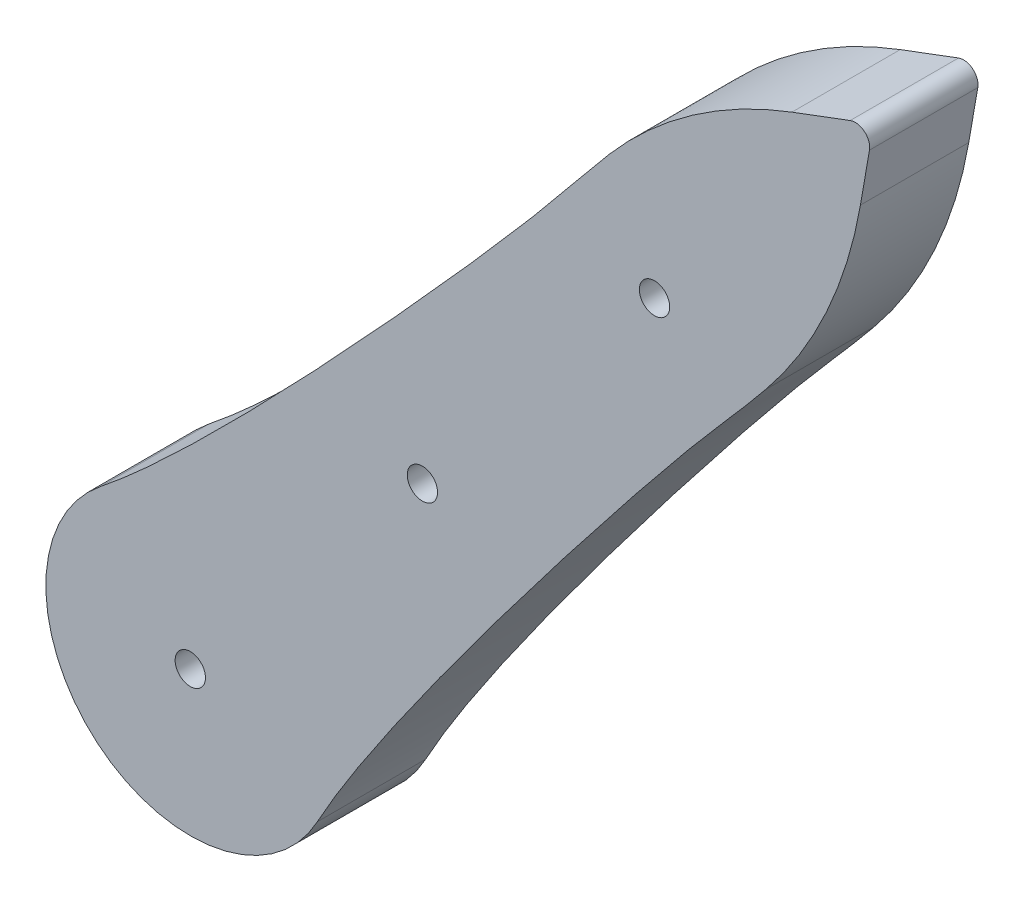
from build123d import *

# Parameters (mm, degrees)
SKETCH3_R           = 1.6
BOSS_EXTRUDE1_DEPTH = 15
CUT_EXTRUDE1_START  = -15
SKETCH4_R           = 1.6
CUT_EXTRUDE1_DEPTH  = 15
FILLET3_R           = 62
SKETCH5_R           = 2.1
CUT_EXTRUDE2_DEPTH  = 15
FILLET4_R           = 2


with BuildPart() as part:
    # Sketch3 → Boss-Extrude1 (new body)
    with BuildSketch(Plane.XY.offset(16)):
        with BuildLine():
            ThreePointArc((155.019115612, -142.985112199), (159.394881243, -97.849485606), (115.704809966, -109.996492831))
            add(Edge.make_bspline(
                [(115.704809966, -109.996492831), (101.94879758, -150.116707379), (78.178790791, -171.772825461), (58.717079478, -197.082387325), (16.356999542, -244.049515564), (0.72448619, -256.46124476)],
                knots=[0, 0, 0, 0, 0.619090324, 0.719090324, 1, 1, 1, 1], degree=3))
            ThreePointArc((0.72448619, -256.46124476), (0.304947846, -287.445485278), (30.74561606, -281.651963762))
            add(Edge.make_bspline(
                [(155.019115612, -142.985112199), (117.897123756, -163.498941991), (100.69762913, -190.668374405), (79.152067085, -214.229377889), (40.254225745, -264.101669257), (30.74561606, -281.651963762)],
                knots=[0, 0, 0, 0, 0.619090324, 0.719090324, 1, 1, 1, 1], degree=3))
        make_face()
        with Locations((135.218221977, -112.415707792)):
            Circle(SKETCH3_R, mode=Mode.SUBTRACT)
        with Locations((148.218221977, -112.415707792)):
            Circle(SKETCH3_R, mode=Mode.SUBTRACT)
        with Locations((148.218221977, -125.415707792)):
            Circle(SKETCH3_R, mode=Mode.SUBTRACT)
        with Locations((135.218221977, -125.415707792)):
            Circle(SKETCH3_R, mode=Mode.SUBTRACT)
        with Locations((77.439461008, -195.520152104)):
            Circle(SKETCH3_R, mode=Mode.SUBTRACT)
        with Locations((45.300080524, -233.82237426)):
            Circle(SKETCH3_R, mode=Mode.SUBTRACT)
        with Locations((13.16070004, -272.124596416)):
            Circle(SKETCH3_R, mode=Mode.SUBTRACT)
    extrude(amount=BOSS_EXTRUDE1_DEPTH)

    # Sketch4 → Cut-Extrude1 (cut)
    with BuildSketch(Plane.XY.offset(31).offset(CUT_EXTRUDE1_START)):
        with BuildLine():
            add(Edge.make_bspline(
                [(115.704809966, -109.996492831), (106.058622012, -138.130164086), (93.113701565, -155.703600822), (81.681620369, -169.238644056)],
                knots=[0, 0, 0, 0, 0.434127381, 0.434127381, 0.434127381, 0.434127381], degree=3))
            Line((81.681620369, -169.238644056), (107.801063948, -159.441089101))
            Line((107.801063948, -159.441089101), (103.173332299, -186.075062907))
            add(Edge.make_bspline(
                [(155.019115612, -142.985112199), (129.435323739, -157.122865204), (114.450199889, -172.627251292), (103.173332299, -186.075062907)],
                knots=[0, 0, 0, 0, 0.426665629, 0.426665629, 0.426665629, 0.426665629], degree=3))
            ThreePointArc((155.019115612, -142.985112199), (157.145110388, -141.681056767), (159.144213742, -140.189748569))
            Line((159.144213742, -140.189748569), (159.161693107, -140.175418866))
            ThreePointArc((159.161693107, -140.175418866), (158.677203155, -97.267544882), (116.900921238, -107.068700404))
            ThreePointArc((116.900921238, -107.068700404), (116.260741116, -108.51538721), (115.704809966, -109.996492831))
        make_face()
        with Locations((135.218221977, -125.415707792)):
            Circle(SKETCH4_R, mode=Mode.SUBTRACT)
        with Locations((148.218221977, -125.415707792)):
            Circle(SKETCH4_R, mode=Mode.SUBTRACT)
        with Locations((135.218221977, -112.415707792)):
            Circle(SKETCH4_R, mode=Mode.SUBTRACT)
        with Locations((148.218221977, -112.415707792)):
            Circle(SKETCH4_R, mode=Mode.SUBTRACT)
    extrude(amount=CUT_EXTRUDE1_DEPTH, mode=Mode.SUBTRACT)


with BuildPart() as cut_extrude1_kept_piece:
    # of the separate pieces the step leaves, the one the design keeps (cut_extrude1_pieces_kept)
    add(part.part.solids().sort_by_distance((30.74561606, -281.651963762, 16))[0])

    # Fillet3
    fillet3_edges = [cut_extrude1_kept_piece.edges().sort_by_distance(p)[0] for p in [
        (81.681620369, -169.238644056, 23.5),
        (103.173332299, -186.075062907, 23.5),
    ]]
    fillet(fillet3_edges, radius=FILLET3_R)

    # Sketch5 → Cut-Extrude2 (cut)
    with BuildSketch(Plane.XY.offset(31)):
        with Locations((77.439461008, -195.520152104)):
            Circle(SKETCH5_R)
        with Locations((45.300080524, -233.82237426)):
            Circle(SKETCH5_R)
        with Locations((13.16070004, -272.124596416)):
            Circle(SKETCH5_R)
    extrude(amount=-CUT_EXTRUDE2_DEPTH, mode=Mode.SUBTRACT)

    # Fillet4
    fillet4_edges = [cut_extrude1_kept_piece.edges().sort_by_distance(p)[0] for p in [
        (107.801063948, -159.441089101, 23.5),
    ]]
    fillet(fillet4_edges, radius=FILLET4_R)


solid = cut_extrude1_kept_piece.part
